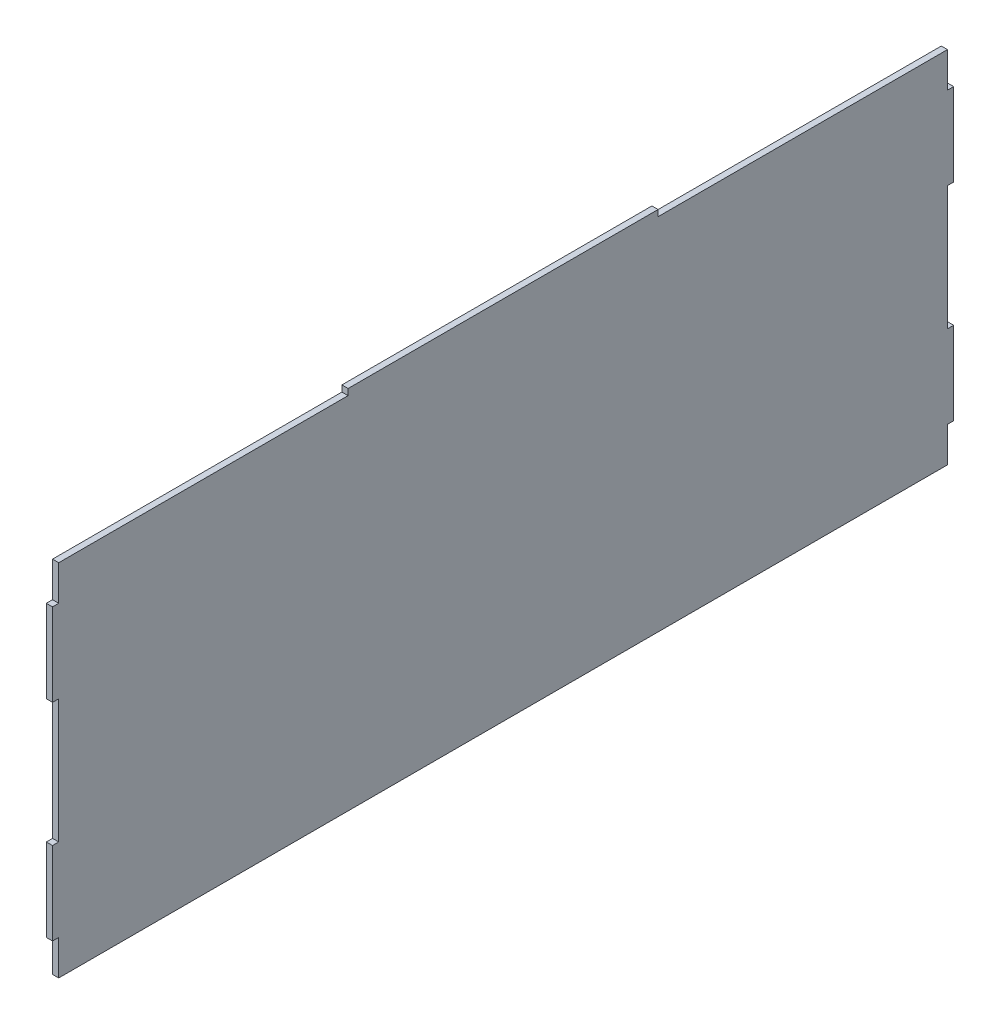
ISO-10303-21;
HEADER;
FILE_DESCRIPTION(('STEP AP214'),'2;1');
FILE_NAME('part.step','',(''),(''),'','','');
FILE_SCHEMA(('AUTOMOTIVE_DESIGN { 1 0 10303 214 1 1 1 1 }'));
ENDSEC;
DATA;
#1=APPLICATION_CONTEXT('core data for automotive mechanical design processes');
#2=APPLICATION_PROTOCOL_DEFINITION('international standard','automotive_design',2000,#1);
#3=PRODUCT_CONTEXT('',#1,'mechanical');
#4=PRODUCT('Part','Part','',(#3));
#5=PRODUCT_RELATED_PRODUCT_CATEGORY('part','',(#4));
#6=PRODUCT_DEFINITION_FORMATION('','',#4);
#7=PRODUCT_DEFINITION_CONTEXT('part definition',#1,'design');
#8=PRODUCT_DEFINITION('design','',#6,#7);
#9=PRODUCT_DEFINITION_SHAPE('','',#8);
#10=(LENGTH_UNIT() NAMED_UNIT(*) SI_UNIT(.MILLI.,.METRE.));
#11=(NAMED_UNIT(*) PLANE_ANGLE_UNIT() SI_UNIT($,.RADIAN.));
#12=(NAMED_UNIT(*) SI_UNIT($,.STERADIAN.) SOLID_ANGLE_UNIT());
#13=UNCERTAINTY_MEASURE_WITH_UNIT(LENGTH_MEASURE(1.E-05),#10,'distance_accuracy_value','');
#14=(GEOMETRIC_REPRESENTATION_CONTEXT(3) GLOBAL_UNCERTAINTY_ASSIGNED_CONTEXT((#13)) GLOBAL_UNIT_ASSIGNED_CONTEXT((#10,
#11,#12)) REPRESENTATION_CONTEXT('',''));
#15=CARTESIAN_POINT('',(0.,0.,0.));
#16=DIRECTION('',(0.,0.,1.));
#17=DIRECTION('',(1.,0.,0.));
#18=AXIS2_PLACEMENT_3D('',#15,#16,#17);
#19=CARTESIAN_POINT('',(0.,414.510974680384,860.));
#20=DIRECTION('',(0.,1.,0.));
#21=DIRECTION('',(0.,0.,1.));
#22=AXIS2_PLACEMENT_3D('',#19,#20,#21);
#23=PLANE('',#22);
#24=DIRECTION('',(-1.,0.,0.));
#25=VECTOR('',#24,1.);
#26=CARTESIAN_POINT('',(0.,414.510974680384,280.));
#27=LINE('',#26,#25);
#28=CARTESIAN_POINT('',(1317.4158437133,414.510974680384,280.));
#29=VERTEX_POINT('',#28);
#30=CARTESIAN_POINT('',(1311.4158437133,414.510974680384,280.));
#31=VERTEX_POINT('',#30);
#32=EDGE_CURVE('E12',#29,#31,#27,.T.);
#33=ORIENTED_EDGE('',*,*,#32,.F.);
#34=DIRECTION('',(0.,0.,-1.));
#35=VECTOR('',#34,1.);
#36=CARTESIAN_POINT('',(1317.4158437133,414.510974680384,860.));
#37=LINE('',#36,#35);
#38=CARTESIAN_POINT('',(1317.4158437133,414.510974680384,0.));
#39=VERTEX_POINT('',#38);
#40=EDGE_CURVE('E212',#29,#39,#37,.T.);
#41=ORIENTED_EDGE('',*,*,#40,.T.);
#42=DIRECTION('',(1.,0.,0.));
#43=VECTOR('',#42,1.);
#44=CARTESIAN_POINT('',(0.,414.510974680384,0.));
#45=LINE('',#44,#43);
#46=CARTESIAN_POINT('',(1311.4158437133,414.510974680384,0.));
#47=VERTEX_POINT('',#46);
#48=EDGE_CURVE('E266',#47,#39,#45,.T.);
#49=ORIENTED_EDGE('',*,*,#48,.F.);
#50=DIRECTION('',(0.,0.,-1.));
#51=VECTOR('',#50,1.);
#52=CARTESIAN_POINT('',(1311.4158437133,414.510974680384,860.));
#53=LINE('',#52,#51);
#54=EDGE_CURVE('E65',#31,#47,#53,.T.);
#55=ORIENTED_EDGE('',*,*,#54,.F.);
#56=EDGE_LOOP('',(#33,#41,#49,#55));
#57=FACE_BOUND('',#56,.T.);
#58=ADVANCED_FACE('F46',(#57),#23,.T.);
#59=CARTESIAN_POINT('',(1311.4158437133,0.,860.));
#60=DIRECTION('',(1.,0.,0.));
#61=DIRECTION('',(0.,0.,-1.));
#62=AXIS2_PLACEMENT_3D('',#59,#60,#61);
#63=PLANE('',#62);
#64=DIRECTION('',(0.,-1.,0.));
#65=VECTOR('',#64,1.);
#66=CARTESIAN_POINT('',(1311.4158437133,408.510974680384,280.));
#67=LINE('',#66,#65);
#68=CARTESIAN_POINT('',(1311.4158437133,420.510974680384,280.));
#69=VERTEX_POINT('',#68);
#70=EDGE_CURVE('E221',#69,#31,#67,.T.);
#71=ORIENTED_EDGE('',*,*,#70,.T.);
#72=ORIENTED_EDGE('',*,*,#54,.T.);
#73=DIRECTION('',(0.,-1.,0.));
#74=VECTOR('',#73,1.);
#75=CARTESIAN_POINT('',(1311.4158437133,0.,0.));
#76=LINE('',#75,#74);
#77=CARTESIAN_POINT('',(1311.4158437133,380.510974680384,0.));
#78=VERTEX_POINT('',#77);
#79=EDGE_CURVE('E279',#47,#78,#76,.T.);
#80=ORIENTED_EDGE('',*,*,#79,.T.);
#81=DIRECTION('',(0.,0.,-1.));
#82=VECTOR('',#81,1.);
#83=CARTESIAN_POINT('',(1311.4158437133,380.510974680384,0.));
#84=LINE('',#83,#82);
#85=CARTESIAN_POINT('',(1311.4158437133,380.510974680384,-6.));
#86=VERTEX_POINT('',#85);
#87=EDGE_CURVE('E243',#78,#86,#84,.T.);
#88=ORIENTED_EDGE('',*,*,#87,.T.);
#89=DIRECTION('',(0.,-1.,0.));
#90=VECTOR('',#89,1.);
#91=CARTESIAN_POINT('',(1311.4158437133,380.510974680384,-6.));
#92=LINE('',#91,#90);
#93=CARTESIAN_POINT('',(1311.4158437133,300.510974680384,-5.99999999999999));
#94=VERTEX_POINT('',#93);
#95=EDGE_CURVE('E299',#86,#94,#92,.T.);
#96=ORIENTED_EDGE('',*,*,#95,.T.);
#97=DIRECTION('',(0.,0.,1.));
#98=VECTOR('',#97,1.);
#99=CARTESIAN_POINT('',(1311.4158437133,300.510974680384,0.));
#100=LINE('',#99,#98);
#101=CARTESIAN_POINT('',(1311.4158437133,300.510974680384,0.));
#102=VERTEX_POINT('',#101);
#103=EDGE_CURVE('E420',#94,#102,#100,.T.);
#104=ORIENTED_EDGE('',*,*,#103,.T.);
#105=DIRECTION('',(0.,-1.,0.));
#106=VECTOR('',#105,1.);
#107=CARTESIAN_POINT('',(1311.4158437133,300.510974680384,0.));
#108=LINE('',#107,#106);
#109=CARTESIAN_POINT('',(1311.4158437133,180.510974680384,0.));
#110=VERTEX_POINT('',#109);
#111=EDGE_CURVE('E427',#102,#110,#108,.T.);
#112=ORIENTED_EDGE('',*,*,#111,.T.);
#113=DIRECTION('',(0.,0.,-1.));
#114=VECTOR('',#113,1.);
#115=CARTESIAN_POINT('',(1311.4158437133,180.510974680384,0.));
#116=LINE('',#115,#114);
#117=CARTESIAN_POINT('',(1311.4158437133,180.510974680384,-6.));
#118=VERTEX_POINT('',#117);
#119=EDGE_CURVE('E432',#110,#118,#116,.T.);
#120=ORIENTED_EDGE('',*,*,#119,.T.);
#121=DIRECTION('',(0.,-1.,0.));
#122=VECTOR('',#121,1.);
#123=CARTESIAN_POINT('',(1311.4158437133,180.510974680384,-6.));
#124=LINE('',#123,#122);
#125=CARTESIAN_POINT('',(1311.4158437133,100.510974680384,-5.99999999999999));
#126=VERTEX_POINT('',#125);
#127=EDGE_CURVE('E436',#118,#126,#124,.T.);
#128=ORIENTED_EDGE('',*,*,#127,.T.);
#129=DIRECTION('',(0.,0.,1.));
#130=VECTOR('',#129,1.);
#131=CARTESIAN_POINT('',(1311.4158437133,100.510974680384,0.));
#132=LINE('',#131,#130);
#133=CARTESIAN_POINT('',(1311.4158437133,100.510974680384,0.));
#134=VERTEX_POINT('',#133);
#135=EDGE_CURVE('E440',#126,#134,#132,.T.);
#136=ORIENTED_EDGE('',*,*,#135,.T.);
#137=DIRECTION('',(0.,-1.,0.));
#138=VECTOR('',#137,1.);
#139=CARTESIAN_POINT('',(1311.4158437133,100.510974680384,0.));
#140=LINE('',#139,#138);
#141=CARTESIAN_POINT('',(1311.4158437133,66.5109746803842,0.));
#142=VERTEX_POINT('',#141);
#143=EDGE_CURVE('E444',#134,#142,#140,.T.);
#144=ORIENTED_EDGE('',*,*,#143,.T.);
#145=DIRECTION('',(0.,0.,1.));
#146=VECTOR('',#145,1.);
#147=CARTESIAN_POINT('',(1311.4158437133,66.5109746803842,0.));
#148=LINE('',#147,#146);
#149=CARTESIAN_POINT('',(1311.4158437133,66.5109746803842,860.));
#150=VERTEX_POINT('',#149);
#151=EDGE_CURVE('E448',#142,#150,#148,.T.);
#152=ORIENTED_EDGE('',*,*,#151,.T.);
#153=DIRECTION('',(0.,1.,0.));
#154=VECTOR('',#153,1.);
#155=CARTESIAN_POINT('',(1311.4158437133,100.510974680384,860.));
#156=LINE('',#155,#154);
#157=CARTESIAN_POINT('',(1311.4158437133,100.510974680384,860.));
#158=VERTEX_POINT('',#157);
#159=EDGE_CURVE('E452',#150,#158,#156,.T.);
#160=ORIENTED_EDGE('',*,*,#159,.T.);
#161=DIRECTION('',(0.,0.,1.));
#162=VECTOR('',#161,1.);
#163=CARTESIAN_POINT('',(1311.4158437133,100.510974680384,860.));
#164=LINE('',#163,#162);
#165=CARTESIAN_POINT('',(1311.4158437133,100.510974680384,866.));
#166=VERTEX_POINT('',#165);
#167=EDGE_CURVE('E456',#158,#166,#164,.T.);
#168=ORIENTED_EDGE('',*,*,#167,.T.);
#169=DIRECTION('',(0.,1.,0.));
#170=VECTOR('',#169,1.);
#171=CARTESIAN_POINT('',(1311.4158437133,180.510974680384,866.));
#172=LINE('',#171,#170);
#173=CARTESIAN_POINT('',(1311.4158437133,180.510974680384,866.));
#174=VERTEX_POINT('',#173);
#175=EDGE_CURVE('E460',#166,#174,#172,.T.);
#176=ORIENTED_EDGE('',*,*,#175,.T.);
#177=DIRECTION('',(0.,0.,-1.));
#178=VECTOR('',#177,1.);
#179=CARTESIAN_POINT('',(1311.4158437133,180.510974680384,860.));
#180=LINE('',#179,#178);
#181=CARTESIAN_POINT('',(1311.4158437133,180.510974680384,860.));
#182=VERTEX_POINT('',#181);
#183=EDGE_CURVE('E464',#174,#182,#180,.T.);
#184=ORIENTED_EDGE('',*,*,#183,.T.);
#185=DIRECTION('',(0.,1.,0.));
#186=VECTOR('',#185,1.);
#187=CARTESIAN_POINT('',(1311.4158437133,300.510974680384,860.));
#188=LINE('',#187,#186);
#189=CARTESIAN_POINT('',(1311.4158437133,300.510974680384,860.));
#190=VERTEX_POINT('',#189);
#191=EDGE_CURVE('E468',#182,#190,#188,.T.);
#192=ORIENTED_EDGE('',*,*,#191,.T.);
#193=DIRECTION('',(0.,0.,1.));
#194=VECTOR('',#193,1.);
#195=CARTESIAN_POINT('',(1311.4158437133,300.510974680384,860.));
#196=LINE('',#195,#194);
#197=CARTESIAN_POINT('',(1311.4158437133,300.510974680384,866.));
#198=VERTEX_POINT('',#197);
#199=EDGE_CURVE('E472',#190,#198,#196,.T.);
#200=ORIENTED_EDGE('',*,*,#199,.T.);
#201=DIRECTION('',(0.,1.,0.));
#202=VECTOR('',#201,1.);
#203=CARTESIAN_POINT('',(1311.4158437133,380.510974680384,866.));
#204=LINE('',#203,#202);
#205=CARTESIAN_POINT('',(1311.4158437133,380.510974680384,866.));
#206=VERTEX_POINT('',#205);
#207=EDGE_CURVE('E250',#198,#206,#204,.T.);
#208=ORIENTED_EDGE('',*,*,#207,.T.);
#209=DIRECTION('',(0.,0.,-1.));
#210=VECTOR('',#209,1.);
#211=CARTESIAN_POINT('',(1311.4158437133,380.510974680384,860.));
#212=LINE('',#211,#210);
#213=CARTESIAN_POINT('',(1311.4158437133,380.510974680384,860.));
#214=VERTEX_POINT('',#213);
#215=EDGE_CURVE('E244',#206,#214,#212,.T.);
#216=ORIENTED_EDGE('',*,*,#215,.T.);
#217=DIRECTION('',(0.,-1.,0.));
#218=VECTOR('',#217,1.);
#219=CARTESIAN_POINT('',(1311.4158437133,0.,860.));
#220=LINE('',#219,#218);
#221=CARTESIAN_POINT('',(1311.4158437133,414.510974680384,860.));
#222=VERTEX_POINT('',#221);
#223=EDGE_CURVE('E260',#222,#214,#220,.T.);
#224=ORIENTED_EDGE('',*,*,#223,.F.);
#225=CARTESIAN_POINT('',(1311.4158437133,414.510974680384,580.));
#226=VERTEX_POINT('',#225);
#227=EDGE_CURVE('E552',#222,#226,#53,.T.);
#228=ORIENTED_EDGE('',*,*,#227,.T.);
#229=DIRECTION('',(0.,1.,0.));
#230=VECTOR('',#229,1.);
#231=CARTESIAN_POINT('',(1311.4158437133,408.510974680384,580.));
#232=LINE('',#231,#230);
#233=CARTESIAN_POINT('',(1311.4158437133,420.510974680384,580.));
#234=VERTEX_POINT('',#233);
#235=EDGE_CURVE('E237',#226,#234,#232,.T.);
#236=ORIENTED_EDGE('',*,*,#235,.T.);
#237=DIRECTION('',(0.,0.,-1.));
#238=VECTOR('',#237,1.);
#239=CARTESIAN_POINT('',(1311.4158437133,420.510974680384,280.));
#240=LINE('',#239,#238);
#241=EDGE_CURVE('E233',#234,#69,#240,.T.);
#242=ORIENTED_EDGE('',*,*,#241,.T.);
#243=EDGE_LOOP('',(#71,#72,#80,#88,#96,#104,#112,#120,#128,#136,#144,#152,#160,#168,#176,#184,
#192,#200,#208,#216,#224,#228,#236,#242));
#244=FACE_BOUND('',#243,.T.);
#245=ADVANCED_FACE('F48',(#244),#63,.F.);
#246=CARTESIAN_POINT('',(1317.4158437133,0.,860.));
#247=DIRECTION('',(1.,0.,0.));
#248=DIRECTION('',(0.,0.,-1.));
#249=AXIS2_PLACEMENT_3D('',#246,#247,#248);
#250=PLANE('',#249);
#251=ORIENTED_EDGE('',*,*,#40,.F.);
#252=DIRECTION('',(0.,-1.,0.));
#253=VECTOR('',#252,1.);
#254=CARTESIAN_POINT('',(1317.4158437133,408.510974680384,280.));
#255=LINE('',#254,#253);
#256=CARTESIAN_POINT('',(1317.4158437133,420.510974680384,280.));
#257=VERTEX_POINT('',#256);
#258=EDGE_CURVE('E204',#257,#29,#255,.T.);
#259=ORIENTED_EDGE('',*,*,#258,.F.);
#260=DIRECTION('',(0.,0.,-1.));
#261=VECTOR('',#260,1.);
#262=CARTESIAN_POINT('',(1317.4158437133,420.510974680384,280.));
#263=LINE('',#262,#261);
#264=CARTESIAN_POINT('',(1317.4158437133,420.510974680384,580.));
#265=VERTEX_POINT('',#264);
#266=EDGE_CURVE('E209',#265,#257,#263,.T.);
#267=ORIENTED_EDGE('',*,*,#266,.F.);
#268=DIRECTION('',(0.,1.,0.));
#269=VECTOR('',#268,1.);
#270=CARTESIAN_POINT('',(1317.4158437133,408.510974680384,580.));
#271=LINE('',#270,#269);
#272=CARTESIAN_POINT('',(1317.4158437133,414.510974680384,580.));
#273=VERTEX_POINT('',#272);
#274=EDGE_CURVE('E215',#273,#265,#271,.T.);
#275=ORIENTED_EDGE('',*,*,#274,.F.);
#276=CARTESIAN_POINT('',(1317.4158437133,414.510974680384,860.));
#277=VERTEX_POINT('',#276);
#278=EDGE_CURVE('E545',#277,#273,#37,.T.);
#279=ORIENTED_EDGE('',*,*,#278,.F.);
#280=DIRECTION('',(0.,-1.,0.));
#281=VECTOR('',#280,1.);
#282=CARTESIAN_POINT('',(1317.4158437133,0.,860.));
#283=LINE('',#282,#281);
#284=CARTESIAN_POINT('',(1317.4158437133,380.510974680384,860.));
#285=VERTEX_POINT('',#284);
#286=EDGE_CURVE('E271',#277,#285,#283,.T.);
#287=ORIENTED_EDGE('',*,*,#286,.T.);
#288=DIRECTION('',(0.,0.,-1.));
#289=VECTOR('',#288,1.);
#290=CARTESIAN_POINT('',(1317.4158437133,380.510974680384,860.));
#291=LINE('',#290,#289);
#292=CARTESIAN_POINT('',(1317.4158437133,380.510974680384,866.));
#293=VERTEX_POINT('',#292);
#294=EDGE_CURVE('E285',#293,#285,#291,.T.);
#295=ORIENTED_EDGE('',*,*,#294,.F.);
#296=DIRECTION('',(0.,1.,0.));
#297=VECTOR('',#296,1.);
#298=CARTESIAN_POINT('',(1317.4158437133,380.510974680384,866.));
#299=LINE('',#298,#297);
#300=CARTESIAN_POINT('',(1317.4158437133,300.510974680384,866.));
#301=VERTEX_POINT('',#300);
#302=EDGE_CURVE('E309',#301,#293,#299,.T.);
#303=ORIENTED_EDGE('',*,*,#302,.F.);
#304=DIRECTION('',(0.,0.,1.));
#305=VECTOR('',#304,1.);
#306=CARTESIAN_POINT('',(1317.4158437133,300.510974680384,860.));
#307=LINE('',#306,#305);
#308=CARTESIAN_POINT('',(1317.4158437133,300.510974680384,860.));
#309=VERTEX_POINT('',#308);
#310=EDGE_CURVE('E314',#309,#301,#307,.T.);
#311=ORIENTED_EDGE('',*,*,#310,.F.);
#312=DIRECTION('',(0.,1.,0.));
#313=VECTOR('',#312,1.);
#314=CARTESIAN_POINT('',(1317.4158437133,300.510974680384,860.));
#315=LINE('',#314,#313);
#316=CARTESIAN_POINT('',(1317.4158437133,180.510974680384,860.));
#317=VERTEX_POINT('',#316);
#318=EDGE_CURVE('E319',#317,#309,#315,.T.);
#319=ORIENTED_EDGE('',*,*,#318,.F.);
#320=DIRECTION('',(0.,0.,-1.));
#321=VECTOR('',#320,1.);
#322=CARTESIAN_POINT('',(1317.4158437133,180.510974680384,860.));
#323=LINE('',#322,#321);
#324=CARTESIAN_POINT('',(1317.4158437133,180.510974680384,866.));
#325=VERTEX_POINT('',#324);
#326=EDGE_CURVE('E324',#325,#317,#323,.T.);
#327=ORIENTED_EDGE('',*,*,#326,.F.);
#328=DIRECTION('',(0.,1.,0.));
#329=VECTOR('',#328,1.);
#330=CARTESIAN_POINT('',(1317.4158437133,180.510974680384,866.));
#331=LINE('',#330,#329);
#332=CARTESIAN_POINT('',(1317.4158437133,100.510974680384,866.));
#333=VERTEX_POINT('',#332);
#334=EDGE_CURVE('E329',#333,#325,#331,.T.);
#335=ORIENTED_EDGE('',*,*,#334,.F.);
#336=DIRECTION('',(0.,0.,1.));
#337=VECTOR('',#336,1.);
#338=CARTESIAN_POINT('',(1317.4158437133,100.510974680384,860.));
#339=LINE('',#338,#337);
#340=CARTESIAN_POINT('',(1317.4158437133,100.510974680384,860.));
#341=VERTEX_POINT('',#340);
#342=EDGE_CURVE('E334',#341,#333,#339,.T.);
#343=ORIENTED_EDGE('',*,*,#342,.F.);
#344=DIRECTION('',(0.,1.,0.));
#345=VECTOR('',#344,1.);
#346=CARTESIAN_POINT('',(1317.4158437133,100.510974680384,860.));
#347=LINE('',#346,#345);
#348=CARTESIAN_POINT('',(1317.4158437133,66.5109746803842,860.));
#349=VERTEX_POINT('',#348);
#350=EDGE_CURVE('E339',#349,#341,#347,.T.);
#351=ORIENTED_EDGE('',*,*,#350,.F.);
#352=DIRECTION('',(0.,0.,1.));
#353=VECTOR('',#352,1.);
#354=CARTESIAN_POINT('',(1317.4158437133,66.5109746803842,0.));
#355=LINE('',#354,#353);
#356=CARTESIAN_POINT('',(1317.4158437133,66.5109746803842,0.));
#357=VERTEX_POINT('',#356);
#358=EDGE_CURVE('E344',#357,#349,#355,.T.);
#359=ORIENTED_EDGE('',*,*,#358,.F.);
#360=DIRECTION('',(0.,-1.,0.));
#361=VECTOR('',#360,1.);
#362=CARTESIAN_POINT('',(1317.4158437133,100.510974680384,0.));
#363=LINE('',#362,#361);
#364=CARTESIAN_POINT('',(1317.4158437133,100.510974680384,0.));
#365=VERTEX_POINT('',#364);
#366=EDGE_CURVE('E349',#365,#357,#363,.T.);
#367=ORIENTED_EDGE('',*,*,#366,.F.);
#368=DIRECTION('',(0.,0.,1.));
#369=VECTOR('',#368,1.);
#370=CARTESIAN_POINT('',(1317.4158437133,100.510974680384,0.));
#371=LINE('',#370,#369);
#372=CARTESIAN_POINT('',(1317.4158437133,100.510974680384,-5.99999999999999));
#373=VERTEX_POINT('',#372);
#374=EDGE_CURVE('E354',#373,#365,#371,.T.);
#375=ORIENTED_EDGE('',*,*,#374,.F.);
#376=DIRECTION('',(0.,-1.,0.));
#377=VECTOR('',#376,1.);
#378=CARTESIAN_POINT('',(1317.4158437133,180.510974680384,-6.));
#379=LINE('',#378,#377);
#380=CARTESIAN_POINT('',(1317.4158437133,180.510974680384,-6.));
#381=VERTEX_POINT('',#380);
#382=EDGE_CURVE('E359',#381,#373,#379,.T.);
#383=ORIENTED_EDGE('',*,*,#382,.F.);
#384=DIRECTION('',(0.,0.,-1.));
#385=VECTOR('',#384,1.);
#386=CARTESIAN_POINT('',(1317.4158437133,180.510974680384,0.));
#387=LINE('',#386,#385);
#388=CARTESIAN_POINT('',(1317.4158437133,180.510974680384,0.));
#389=VERTEX_POINT('',#388);
#390=EDGE_CURVE('E364',#389,#381,#387,.T.);
#391=ORIENTED_EDGE('',*,*,#390,.F.);
#392=DIRECTION('',(0.,-1.,0.));
#393=VECTOR('',#392,1.);
#394=CARTESIAN_POINT('',(1317.4158437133,300.510974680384,0.));
#395=LINE('',#394,#393);
#396=CARTESIAN_POINT('',(1317.4158437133,300.510974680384,0.));
#397=VERTEX_POINT('',#396);
#398=EDGE_CURVE('E369',#397,#389,#395,.T.);
#399=ORIENTED_EDGE('',*,*,#398,.F.);
#400=DIRECTION('',(0.,0.,1.));
#401=VECTOR('',#400,1.);
#402=CARTESIAN_POINT('',(1317.4158437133,300.510974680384,0.));
#403=LINE('',#402,#401);
#404=CARTESIAN_POINT('',(1317.4158437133,300.510974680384,-5.99999999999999));
#405=VERTEX_POINT('',#404);
#406=EDGE_CURVE('E374',#405,#397,#403,.T.);
#407=ORIENTED_EDGE('',*,*,#406,.F.);
#408=DIRECTION('',(0.,-1.,0.));
#409=VECTOR('',#408,1.);
#410=CARTESIAN_POINT('',(1317.4158437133,380.510974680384,-6.));
#411=LINE('',#410,#409);
#412=CARTESIAN_POINT('',(1317.4158437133,380.510974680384,-6.));
#413=VERTEX_POINT('',#412);
#414=EDGE_CURVE('E379',#413,#405,#411,.T.);
#415=ORIENTED_EDGE('',*,*,#414,.F.);
#416=DIRECTION('',(0.,0.,-1.));
#417=VECTOR('',#416,1.);
#418=CARTESIAN_POINT('',(1317.4158437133,380.510974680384,0.));
#419=LINE('',#418,#417);
#420=CARTESIAN_POINT('',(1317.4158437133,380.510974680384,0.));
#421=VERTEX_POINT('',#420);
#422=EDGE_CURVE('E249',#421,#413,#419,.T.);
#423=ORIENTED_EDGE('',*,*,#422,.F.);
#424=DIRECTION('',(0.,-1.,0.));
#425=VECTOR('',#424,1.);
#426=CARTESIAN_POINT('',(1317.4158437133,0.,0.));
#427=LINE('',#426,#425);
#428=EDGE_CURVE('E482',#39,#421,#427,.T.);
#429=ORIENTED_EDGE('',*,*,#428,.F.);
#430=EDGE_LOOP('',(#251,#259,#267,#275,#279,#287,#295,#303,#311,#319,#327,#335,#343,#351,#359,
#367,#375,#383,#391,#399,#407,#415,#423,#429));
#431=FACE_BOUND('',#430,.T.);
#432=ADVANCED_FACE('F206',(#431),#250,.T.);
#433=DIRECTION('',(1.,0.,0.));
#434=VECTOR('',#433,1.);
#435=CARTESIAN_POINT('',(0.,414.510974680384,580.));
#436=LINE('',#435,#434);
#437=EDGE_CURVE('E55',#226,#273,#436,.T.);
#438=ORIENTED_EDGE('',*,*,#437,.F.);
#439=ORIENTED_EDGE('',*,*,#227,.F.);
#440=DIRECTION('',(1.,0.,0.));
#441=VECTOR('',#440,1.);
#442=CARTESIAN_POINT('',(0.,414.510974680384,860.));
#443=LINE('',#442,#441);
#444=EDGE_CURVE('E275',#222,#277,#443,.T.);
#445=ORIENTED_EDGE('',*,*,#444,.T.);
#446=ORIENTED_EDGE('',*,*,#278,.T.);
#447=EDGE_LOOP('',(#438,#439,#445,#446));
#448=FACE_BOUND('',#447,.T.);
#449=ADVANCED_FACE('F565',(#448),#23,.T.);
#450=CARTESIAN_POINT('',(0.,0.,860.));
#451=DIRECTION('',(0.,0.,1.));
#452=DIRECTION('',(1.,0.,0.));
#453=AXIS2_PLACEMENT_3D('',#450,#451,#452);
#454=PLANE('',#453);
#455=ORIENTED_EDGE('',*,*,#223,.T.);
#456=DIRECTION('',(1.,0.,0.));
#457=VECTOR('',#456,1.);
#458=CARTESIAN_POINT('',(0.,380.510974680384,860.));
#459=LINE('',#458,#457);
#460=EDGE_CURVE('E265',#214,#285,#459,.T.);
#461=ORIENTED_EDGE('',*,*,#460,.T.);
#462=ORIENTED_EDGE('',*,*,#286,.F.);
#463=ORIENTED_EDGE('',*,*,#444,.F.);
#464=EDGE_LOOP('',(#455,#461,#462,#463));
#465=FACE_BOUND('',#464,.T.);
#466=ADVANCED_FACE('F544',(#465),#454,.T.);
#467=CARTESIAN_POINT('',(0.,0.,0.));
#468=DIRECTION('',(0.,0.,1.));
#469=DIRECTION('',(1.,0.,0.));
#470=AXIS2_PLACEMENT_3D('',#467,#468,#469);
#471=PLANE('',#470);
#472=ORIENTED_EDGE('',*,*,#79,.F.);
#473=ORIENTED_EDGE('',*,*,#48,.T.);
#474=ORIENTED_EDGE('',*,*,#428,.T.);
#475=DIRECTION('',(1.,0.,0.));
#476=VECTOR('',#475,1.);
#477=CARTESIAN_POINT('',(0.,380.510974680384,0.));
#478=LINE('',#477,#476);
#479=EDGE_CURVE('E284',#78,#421,#478,.T.);
#480=ORIENTED_EDGE('',*,*,#479,.F.);
#481=EDGE_LOOP('',(#472,#473,#474,#480));
#482=FACE_BOUND('',#481,.T.);
#483=ADVANCED_FACE('F562',(#482),#471,.F.);
#484=CARTESIAN_POINT('',(2256.29176735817,380.510974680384,0.));
#485=DIRECTION('',(0.,1.,0.));
#486=DIRECTION('',(0.,0.,1.));
#487=AXIS2_PLACEMENT_3D('',#484,#485,#486);
#488=PLANE('',#487);
#489=ORIENTED_EDGE('',*,*,#479,.T.);
#490=ORIENTED_EDGE('',*,*,#422,.T.);
#491=DIRECTION('',(-1.,0.,0.));
#492=VECTOR('',#491,1.);
#493=CARTESIAN_POINT('',(2256.29176735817,380.510974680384,-6.));
#494=LINE('',#493,#492);
#495=EDGE_CURVE('E267',#413,#86,#494,.T.);
#496=ORIENTED_EDGE('',*,*,#495,.T.);
#497=ORIENTED_EDGE('',*,*,#87,.F.);
#498=EDGE_LOOP('',(#489,#490,#496,#497));
#499=FACE_BOUND('',#498,.T.);
#500=ADVANCED_FACE('F480',(#499),#488,.T.);
#501=CARTESIAN_POINT('',(2256.29176735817,380.510974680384,-6.));
#502=DIRECTION('',(0.,0.,-1.));
#503=DIRECTION('',(0.,1.,0.));
#504=AXIS2_PLACEMENT_3D('',#501,#502,#503);
#505=PLANE('',#504);
#506=ORIENTED_EDGE('',*,*,#495,.F.);
#507=ORIENTED_EDGE('',*,*,#414,.T.);
#508=DIRECTION('',(-1.,0.,0.));
#509=VECTOR('',#508,1.);
#510=CARTESIAN_POINT('',(2256.29176735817,300.510974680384,-5.99999999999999));
#511=LINE('',#510,#509);
#512=EDGE_CURVE('E378',#405,#94,#511,.T.);
#513=ORIENTED_EDGE('',*,*,#512,.T.);
#514=ORIENTED_EDGE('',*,*,#95,.F.);
#515=EDGE_LOOP('',(#506,#507,#513,#514));
#516=FACE_BOUND('',#515,.T.);
#517=ADVANCED_FACE('F416',(#516),#505,.T.);
#518=CARTESIAN_POINT('',(2256.29176735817,300.510974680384,0.));
#519=DIRECTION('',(0.,-1.,0.));
#520=DIRECTION('',(0.,0.,-1.));
#521=AXIS2_PLACEMENT_3D('',#518,#519,#520);
#522=PLANE('',#521);
#523=ORIENTED_EDGE('',*,*,#512,.F.);
#524=ORIENTED_EDGE('',*,*,#406,.T.);
#525=DIRECTION('',(-1.,0.,0.));
#526=VECTOR('',#525,1.);
#527=CARTESIAN_POINT('',(2256.29176735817,300.510974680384,0.));
#528=LINE('',#527,#526);
#529=EDGE_CURVE('E373',#397,#102,#528,.T.);
#530=ORIENTED_EDGE('',*,*,#529,.T.);
#531=ORIENTED_EDGE('',*,*,#103,.F.);
#532=EDGE_LOOP('',(#523,#524,#530,#531));
#533=FACE_BOUND('',#532,.T.);
#534=ADVANCED_FACE('F421',(#533),#522,.T.);
#535=CARTESIAN_POINT('',(2256.29176735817,300.510974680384,0.));
#536=DIRECTION('',(0.,0.,-1.));
#537=DIRECTION('',(-1.,0.,0.));
#538=AXIS2_PLACEMENT_3D('',#535,#536,#537);
#539=PLANE('',#538);
#540=ORIENTED_EDGE('',*,*,#529,.F.);
#541=ORIENTED_EDGE('',*,*,#398,.T.);
#542=DIRECTION('',(-1.,0.,0.));
#543=VECTOR('',#542,1.);
#544=CARTESIAN_POINT('',(2256.29176735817,180.510974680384,0.));
#545=LINE('',#544,#543);
#546=EDGE_CURVE('E368',#389,#110,#545,.T.);
#547=ORIENTED_EDGE('',*,*,#546,.T.);
#548=ORIENTED_EDGE('',*,*,#111,.F.);
#549=EDGE_LOOP('',(#540,#541,#547,#548));
#550=FACE_BOUND('',#549,.T.);
#551=ADVANCED_FACE('F486',(#550),#539,.T.);
#552=CARTESIAN_POINT('',(2256.29176735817,180.510974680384,0.));
#553=DIRECTION('',(0.,1.,0.));
#554=DIRECTION('',(0.,0.,1.));
#555=AXIS2_PLACEMENT_3D('',#552,#553,#554);
#556=PLANE('',#555);
#557=ORIENTED_EDGE('',*,*,#546,.F.);
#558=ORIENTED_EDGE('',*,*,#390,.T.);
#559=DIRECTION('',(-1.,0.,0.));
#560=VECTOR('',#559,1.);
#561=CARTESIAN_POINT('',(2256.29176735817,180.510974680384,-6.));
#562=LINE('',#561,#560);
#563=EDGE_CURVE('E363',#381,#118,#562,.T.);
#564=ORIENTED_EDGE('',*,*,#563,.T.);
#565=ORIENTED_EDGE('',*,*,#119,.F.);
#566=EDGE_LOOP('',(#557,#558,#564,#565));
#567=FACE_BOUND('',#566,.T.);
#568=ADVANCED_FACE('F490',(#567),#556,.T.);
#569=CARTESIAN_POINT('',(2256.29176735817,180.510974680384,-6.));
#570=DIRECTION('',(0.,0.,-1.));
#571=DIRECTION('',(0.,1.,0.));
#572=AXIS2_PLACEMENT_3D('',#569,#570,#571);
#573=PLANE('',#572);
#574=ORIENTED_EDGE('',*,*,#563,.F.);
#575=ORIENTED_EDGE('',*,*,#382,.T.);
#576=DIRECTION('',(-1.,0.,0.));
#577=VECTOR('',#576,1.);
#578=CARTESIAN_POINT('',(2256.29176735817,100.510974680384,-5.99999999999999));
#579=LINE('',#578,#577);
#580=EDGE_CURVE('E358',#373,#126,#579,.T.);
#581=ORIENTED_EDGE('',*,*,#580,.T.);
#582=ORIENTED_EDGE('',*,*,#127,.F.);
#583=EDGE_LOOP('',(#574,#575,#581,#582));
#584=FACE_BOUND('',#583,.T.);
#585=ADVANCED_FACE('F493',(#584),#573,.T.);
#586=CARTESIAN_POINT('',(2256.29176735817,100.510974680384,0.));
#587=DIRECTION('',(0.,-1.,0.));
#588=DIRECTION('',(0.,0.,-1.));
#589=AXIS2_PLACEMENT_3D('',#586,#587,#588);
#590=PLANE('',#589);
#591=ORIENTED_EDGE('',*,*,#580,.F.);
#592=ORIENTED_EDGE('',*,*,#374,.T.);
#593=DIRECTION('',(-1.,0.,0.));
#594=VECTOR('',#593,1.);
#595=CARTESIAN_POINT('',(2256.29176735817,100.510974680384,0.));
#596=LINE('',#595,#594);
#597=EDGE_CURVE('E353',#365,#134,#596,.T.);
#598=ORIENTED_EDGE('',*,*,#597,.T.);
#599=ORIENTED_EDGE('',*,*,#135,.F.);
#600=EDGE_LOOP('',(#591,#592,#598,#599));
#601=FACE_BOUND('',#600,.T.);
#602=ADVANCED_FACE('F497',(#601),#590,.T.);
#603=CARTESIAN_POINT('',(2256.29176735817,100.510974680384,0.));
#604=DIRECTION('',(0.,0.,-1.));
#605=DIRECTION('',(-1.,0.,0.));
#606=AXIS2_PLACEMENT_3D('',#603,#604,#605);
#607=PLANE('',#606);
#608=ORIENTED_EDGE('',*,*,#597,.F.);
#609=ORIENTED_EDGE('',*,*,#366,.T.);
#610=DIRECTION('',(-1.,0.,0.));
#611=VECTOR('',#610,1.);
#612=CARTESIAN_POINT('',(2256.29176735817,66.5109746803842,0.));
#613=LINE('',#612,#611);
#614=EDGE_CURVE('E348',#357,#142,#613,.T.);
#615=ORIENTED_EDGE('',*,*,#614,.T.);
#616=ORIENTED_EDGE('',*,*,#143,.F.);
#617=EDGE_LOOP('',(#608,#609,#615,#616));
#618=FACE_BOUND('',#617,.T.);
#619=ADVANCED_FACE('F502',(#618),#607,.T.);
#620=CARTESIAN_POINT('',(2256.29176735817,66.5109746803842,0.));
#621=DIRECTION('',(0.,-1.,0.));
#622=DIRECTION('',(0.,0.,-1.));
#623=AXIS2_PLACEMENT_3D('',#620,#621,#622);
#624=PLANE('',#623);
#625=ORIENTED_EDGE('',*,*,#614,.F.);
#626=ORIENTED_EDGE('',*,*,#358,.T.);
#627=DIRECTION('',(-1.,0.,0.));
#628=VECTOR('',#627,1.);
#629=CARTESIAN_POINT('',(2256.29176735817,66.5109746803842,860.));
#630=LINE('',#629,#628);
#631=EDGE_CURVE('E343',#349,#150,#630,.T.);
#632=ORIENTED_EDGE('',*,*,#631,.T.);
#633=ORIENTED_EDGE('',*,*,#151,.F.);
#634=EDGE_LOOP('',(#625,#626,#632,#633));
#635=FACE_BOUND('',#634,.T.);
#636=ADVANCED_FACE('F505',(#635),#624,.T.);
#637=CARTESIAN_POINT('',(2256.29176735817,100.510974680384,860.));
#638=DIRECTION('',(0.,0.,1.));
#639=DIRECTION('',(1.,0.,0.));
#640=AXIS2_PLACEMENT_3D('',#637,#638,#639);
#641=PLANE('',#640);
#642=ORIENTED_EDGE('',*,*,#631,.F.);
#643=ORIENTED_EDGE('',*,*,#350,.T.);
#644=DIRECTION('',(-1.,0.,0.));
#645=VECTOR('',#644,1.);
#646=CARTESIAN_POINT('',(2256.29176735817,100.510974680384,860.));
#647=LINE('',#646,#645);
#648=EDGE_CURVE('E338',#341,#158,#647,.T.);
#649=ORIENTED_EDGE('',*,*,#648,.T.);
#650=ORIENTED_EDGE('',*,*,#159,.F.);
#651=EDGE_LOOP('',(#642,#643,#649,#650));
#652=FACE_BOUND('',#651,.T.);
#653=ADVANCED_FACE('F509',(#652),#641,.T.);
#654=CARTESIAN_POINT('',(2256.29176735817,100.510974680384,860.));
#655=DIRECTION('',(0.,-1.,0.));
#656=DIRECTION('',(0.,0.,-1.));
#657=AXIS2_PLACEMENT_3D('',#654,#655,#656);
#658=PLANE('',#657);
#659=ORIENTED_EDGE('',*,*,#648,.F.);
#660=ORIENTED_EDGE('',*,*,#342,.T.);
#661=DIRECTION('',(-1.,0.,0.));
#662=VECTOR('',#661,1.);
#663=CARTESIAN_POINT('',(2256.29176735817,100.510974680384,866.));
#664=LINE('',#663,#662);
#665=EDGE_CURVE('E333',#333,#166,#664,.T.);
#666=ORIENTED_EDGE('',*,*,#665,.T.);
#667=ORIENTED_EDGE('',*,*,#167,.F.);
#668=EDGE_LOOP('',(#659,#660,#666,#667));
#669=FACE_BOUND('',#668,.T.);
#670=ADVANCED_FACE('F514',(#669),#658,.T.);
#671=CARTESIAN_POINT('',(2256.29176735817,180.510974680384,866.));
#672=DIRECTION('',(0.,0.,1.));
#673=DIRECTION('',(1.,0.,0.));
#674=AXIS2_PLACEMENT_3D('',#671,#672,#673);
#675=PLANE('',#674);
#676=ORIENTED_EDGE('',*,*,#665,.F.);
#677=ORIENTED_EDGE('',*,*,#334,.T.);
#678=DIRECTION('',(-1.,0.,0.));
#679=VECTOR('',#678,1.);
#680=CARTESIAN_POINT('',(2256.29176735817,180.510974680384,866.));
#681=LINE('',#680,#679);
#682=EDGE_CURVE('E328',#325,#174,#681,.T.);
#683=ORIENTED_EDGE('',*,*,#682,.T.);
#684=ORIENTED_EDGE('',*,*,#175,.F.);
#685=EDGE_LOOP('',(#676,#677,#683,#684));
#686=FACE_BOUND('',#685,.T.);
#687=ADVANCED_FACE('F517',(#686),#675,.T.);
#688=CARTESIAN_POINT('',(2256.29176735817,180.510974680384,860.));
#689=DIRECTION('',(0.,1.,0.));
#690=DIRECTION('',(0.,0.,1.));
#691=AXIS2_PLACEMENT_3D('',#688,#689,#690);
#692=PLANE('',#691);
#693=ORIENTED_EDGE('',*,*,#682,.F.);
#694=ORIENTED_EDGE('',*,*,#326,.T.);
#695=DIRECTION('',(-1.,0.,0.));
#696=VECTOR('',#695,1.);
#697=CARTESIAN_POINT('',(2256.29176735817,180.510974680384,860.));
#698=LINE('',#697,#696);
#699=EDGE_CURVE('E323',#317,#182,#698,.T.);
#700=ORIENTED_EDGE('',*,*,#699,.T.);
#701=ORIENTED_EDGE('',*,*,#183,.F.);
#702=EDGE_LOOP('',(#693,#694,#700,#701));
#703=FACE_BOUND('',#702,.T.);
#704=ADVANCED_FACE('F521',(#703),#692,.T.);
#705=CARTESIAN_POINT('',(2256.29176735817,300.510974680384,860.));
#706=DIRECTION('',(0.,0.,1.));
#707=DIRECTION('',(1.,0.,0.));
#708=AXIS2_PLACEMENT_3D('',#705,#706,#707);
#709=PLANE('',#708);
#710=ORIENTED_EDGE('',*,*,#699,.F.);
#711=ORIENTED_EDGE('',*,*,#318,.T.);
#712=DIRECTION('',(-1.,0.,0.));
#713=VECTOR('',#712,1.);
#714=CARTESIAN_POINT('',(2256.29176735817,300.510974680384,860.));
#715=LINE('',#714,#713);
#716=EDGE_CURVE('E318',#309,#190,#715,.T.);
#717=ORIENTED_EDGE('',*,*,#716,.T.);
#718=ORIENTED_EDGE('',*,*,#191,.F.);
#719=EDGE_LOOP('',(#710,#711,#717,#718));
#720=FACE_BOUND('',#719,.T.);
#721=ADVANCED_FACE('F526',(#720),#709,.T.);
#722=CARTESIAN_POINT('',(2256.29176735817,300.510974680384,860.));
#723=DIRECTION('',(0.,-1.,0.));
#724=DIRECTION('',(0.,0.,-1.));
#725=AXIS2_PLACEMENT_3D('',#722,#723,#724);
#726=PLANE('',#725);
#727=ORIENTED_EDGE('',*,*,#716,.F.);
#728=ORIENTED_EDGE('',*,*,#310,.T.);
#729=DIRECTION('',(-1.,0.,0.));
#730=VECTOR('',#729,1.);
#731=CARTESIAN_POINT('',(2256.29176735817,300.510974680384,866.));
#732=LINE('',#731,#730);
#733=EDGE_CURVE('E313',#301,#198,#732,.T.);
#734=ORIENTED_EDGE('',*,*,#733,.T.);
#735=ORIENTED_EDGE('',*,*,#199,.F.);
#736=EDGE_LOOP('',(#727,#728,#734,#735));
#737=FACE_BOUND('',#736,.T.);
#738=ADVANCED_FACE('F529',(#737),#726,.T.);
#739=CARTESIAN_POINT('',(2256.29176735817,380.510974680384,866.));
#740=DIRECTION('',(0.,0.,1.));
#741=DIRECTION('',(1.,0.,0.));
#742=AXIS2_PLACEMENT_3D('',#739,#740,#741);
#743=PLANE('',#742);
#744=ORIENTED_EDGE('',*,*,#733,.F.);
#745=ORIENTED_EDGE('',*,*,#302,.T.);
#746=DIRECTION('',(-1.,0.,0.));
#747=VECTOR('',#746,1.);
#748=CARTESIAN_POINT('',(2256.29176735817,380.510974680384,866.));
#749=LINE('',#748,#747);
#750=EDGE_CURVE('E308',#293,#206,#749,.T.);
#751=ORIENTED_EDGE('',*,*,#750,.T.);
#752=ORIENTED_EDGE('',*,*,#207,.F.);
#753=EDGE_LOOP('',(#744,#745,#751,#752));
#754=FACE_BOUND('',#753,.T.);
#755=ADVANCED_FACE('F533',(#754),#743,.T.);
#756=CARTESIAN_POINT('',(2256.29176735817,380.510974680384,860.));
#757=DIRECTION('',(0.,1.,0.));
#758=DIRECTION('',(0.,0.,1.));
#759=AXIS2_PLACEMENT_3D('',#756,#757,#758);
#760=PLANE('',#759);
#761=ORIENTED_EDGE('',*,*,#750,.F.);
#762=ORIENTED_EDGE('',*,*,#294,.T.);
#763=ORIENTED_EDGE('',*,*,#460,.F.);
#764=ORIENTED_EDGE('',*,*,#215,.F.);
#765=EDGE_LOOP('',(#761,#762,#763,#764));
#766=FACE_BOUND('',#765,.T.);
#767=ADVANCED_FACE('F541',(#766),#760,.T.);
#768=CARTESIAN_POINT('',(1617.65574779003,420.510974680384,280.));
#769=DIRECTION('',(0.,1.,0.));
#770=DIRECTION('',(0.,0.,1.));
#771=AXIS2_PLACEMENT_3D('',#768,#769,#770);
#772=PLANE('',#771);
#773=DIRECTION('',(-1.,0.,0.));
#774=VECTOR('',#773,1.);
#775=CARTESIAN_POINT('',(1617.65574779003,420.510974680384,580.));
#776=LINE('',#775,#774);
#777=EDGE_CURVE('E229',#265,#234,#776,.T.);
#778=ORIENTED_EDGE('',*,*,#777,.F.);
#779=ORIENTED_EDGE('',*,*,#266,.T.);
#780=DIRECTION('',(-1.,0.,0.));
#781=VECTOR('',#780,1.);
#782=CARTESIAN_POINT('',(1617.65574779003,420.510974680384,280.));
#783=LINE('',#782,#781);
#784=EDGE_CURVE('E216',#257,#69,#783,.T.);
#785=ORIENTED_EDGE('',*,*,#784,.T.);
#786=ORIENTED_EDGE('',*,*,#241,.F.);
#787=EDGE_LOOP('',(#778,#779,#785,#786));
#788=FACE_BOUND('',#787,.T.);
#789=ADVANCED_FACE('F227',(#788),#772,.T.);
#790=CARTESIAN_POINT('',(1617.65574779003,408.510974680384,280.));
#791=DIRECTION('',(0.,0.,-1.));
#792=DIRECTION('',(-1.,0.,0.));
#793=AXIS2_PLACEMENT_3D('',#790,#791,#792);
#794=PLANE('',#793);
#795=ORIENTED_EDGE('',*,*,#258,.T.);
#796=ORIENTED_EDGE('',*,*,#32,.T.);
#797=ORIENTED_EDGE('',*,*,#70,.F.);
#798=ORIENTED_EDGE('',*,*,#784,.F.);
#799=EDGE_LOOP('',(#795,#796,#797,#798));
#800=FACE_BOUND('',#799,.T.);
#801=ADVANCED_FACE('F219',(#800),#794,.T.);
#802=CARTESIAN_POINT('',(1617.65574779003,408.510974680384,580.));
#803=DIRECTION('',(0.,0.,1.));
#804=DIRECTION('',(1.,0.,0.));
#805=AXIS2_PLACEMENT_3D('',#802,#803,#804);
#806=PLANE('',#805);
#807=ORIENTED_EDGE('',*,*,#235,.F.);
#808=ORIENTED_EDGE('',*,*,#437,.T.);
#809=ORIENTED_EDGE('',*,*,#274,.T.);
#810=ORIENTED_EDGE('',*,*,#777,.T.);
#811=EDGE_LOOP('',(#807,#808,#809,#810));
#812=FACE_BOUND('',#811,.T.);
#813=ADVANCED_FACE('F578',(#812),#806,.T.);
#814=CLOSED_SHELL('',(#58,#245,#432,#449,#466,#483,#500,#517,#534,#551,#568,#585,#602,#619,#636,
#653,#670,#687,#704,#721,#738,#755,#767,#789,#801,#813));
#815=MANIFOLD_SOLID_BREP('B2',#814);
#816=ADVANCED_BREP_SHAPE_REPRESENTATION('',(#18,#815),#14);
#817=SHAPE_DEFINITION_REPRESENTATION(#9,#816);
ENDSEC;
END-ISO-10303-21;
